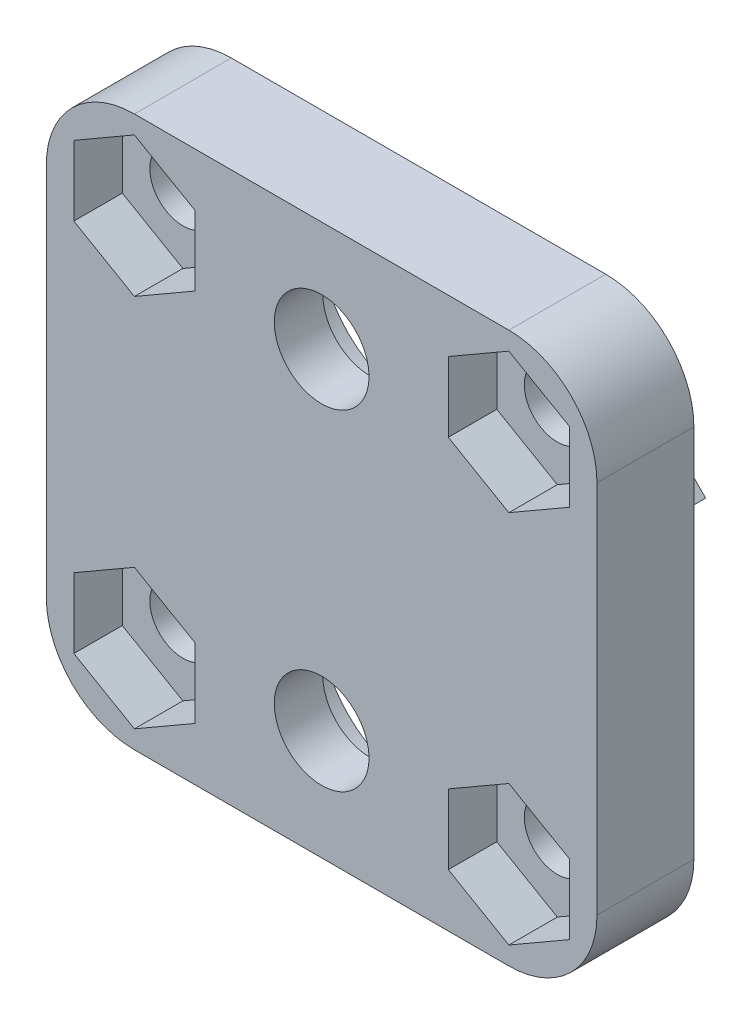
from build123d import *

# Parameters (mm, degrees)
BOSS_EXTRU_1_DEPTH              = 2.2
ENL_V_MAT_EXTRU_1_DEPTH         = 2.2
ESQUISSE3_R                     = 1.5
ENL_V_MAT_EXTRU_2_DEPTH         = 2.2
R_P_TITION_LIN_AIRE1_COUNT      = 10
R_P_TITION_LIN_AIRE1_PITCH      = 17
R_P_TITION_LIN_AIRE1_COUNT_DIR2 = 2
R_P_TITION_LIN_AIRE1_PITCH_DIR2 = 17
ESQUISSE5_R                     = 4.5
ENL_V_MAT_EXTRU_3_DEPTH         = 2.2
ESQUISSE6_R                     = 2.15
ENL_V_MAT_EXTRU_4_DEPTH         = 2.2
BOSS_EXTRU_2_DEPTH              = 1
R_P_TITION_CIRCULAIRE1_COUNT    = 2


with BuildPart() as part:
    # Esquisse1 → Boss.-Extru.1 (new, symmetric)
    with BuildSketch(Plane.XY):
        with BuildLine():
            Line((17, 21), (0, 21))
            ThreePointArc((0, 21), (-2.828427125, 19.828427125), (-4, 17))
            Line((-4, 17), (-4, 0))
            ThreePointArc((-4, 0), (-2.828427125, -2.828427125), (0, -4))
            Line((0, -4), (17, -4))
            ThreePointArc((17, -4), (19.828427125, -2.828427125), (21, 0))
            Line((21, 0), (21, 17))
            ThreePointArc((21, 17), (19.828427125, 19.828427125), (17, 21))
        make_face()
    extrude(amount=BOSS_EXTRU_1_DEPTH, both=True)

    # Esquisse2 → Enl_v. mat.-Extru.1 (cut)
    with BuildSketch(Plane.XY.offset(2.2)):
        Polygon((19.75, 15.41228676), (19.75, 18.58771324), (17, 20.175426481), (14.25, 18.58771324), (14.25, 15.41228676), (17, 13.824573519), align=None)
    enl_v_mat_extru_1 = extrude(amount=-ENL_V_MAT_EXTRU_1_DEPTH, mode=Mode.SUBTRACT)

    # Esquisse3 → Enl_v. mat.-Extru.2 (cut)
    with BuildSketch(Plane.XY):
        with Locations((17, 17)):
            Circle(ESQUISSE3_R)
    enl_v_mat_extru_2 = extrude(amount=-ENL_V_MAT_EXTRU_2_DEPTH, mode=Mode.SUBTRACT)

    # R_p_tition lin_aire1: Enl_v. mat.-Extru.1, Enl_v. mat.-Extru.2 10 × 2
    with Locations(*[(-i * R_P_TITION_LIN_AIRE1_PITCH, -j * R_P_TITION_LIN_AIRE1_PITCH_DIR2, 0) for i in range(R_P_TITION_LIN_AIRE1_COUNT) for j in range(R_P_TITION_LIN_AIRE1_COUNT_DIR2) if (i, j) != (0, 0)]):
        add(enl_v_mat_extru_1, mode=Mode.SUBTRACT)
        add(enl_v_mat_extru_2, mode=Mode.SUBTRACT)

    # Esquisse5 → Enl_v. mat.-Extru.3 (cut)
    with BuildSketch(Plane(origin=(0, 0, -2.2), x_dir=(-1, 0, 0), z_dir=(0, 0, -1))):
        with Locations((-8.5, 16)):
            Circle(ESQUISSE5_R)
        with Locations((-8.5, 1)):
            Circle(ESQUISSE5_R)
    extrude(amount=-ENL_V_MAT_EXTRU_3_DEPTH, mode=Mode.SUBTRACT)

    # Esquisse6 → Enl_v. mat.-Extru.4 (cut)
    with BuildSketch(Plane(origin=(0, 0, 0), x_dir=(-1, 0, 0), z_dir=(0, 0, -1))):
        with Locations((-8.5, 16)):
            Circle(ESQUISSE6_R)
        with Locations((-8.5, 1)):
            Circle(ESQUISSE6_R)
    extrude(amount=-ENL_V_MAT_EXTRU_4_DEPTH, mode=Mode.SUBTRACT)

    # Esquisse4 → Boss.-Extru.2 (add)
    with BuildSketch(Plane(origin=(0, 0, -2.2), x_dir=(-1, 0, 0), z_dir=(0, 0, -1))):
        with BuildLine():
            Line((-13.723391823, 14.705694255), (-12.904239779, 14.132117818))
            ThreePointArc((-12.904239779, 14.132117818), (-16.564221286, 12.01902651), (-20.535533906, 13.464466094))
            Line((-20.535533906, 13.464466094), (-19.828427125, 14.171572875))
            ThreePointArc((-19.828427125, 14.171572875), (-16.651377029, 13.015221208), (-13.723391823, 14.705694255))
        make_face()
    boss_extru_2 = extrude(amount=BOSS_EXTRU_2_DEPTH)

    # R_p_tition circulaire1: Boss.-Extru.2 ×2 about axis
    r_p_tition_circulaire1_axis = Axis((8.5, 8.5, 0), (0, 0, 1))
    for i in range(1, R_P_TITION_CIRCULAIRE1_COUNT):
        add(boss_extru_2.rotate(r_p_tition_circulaire1_axis, i * 360 / R_P_TITION_CIRCULAIRE1_COUNT))


solid = part.part
